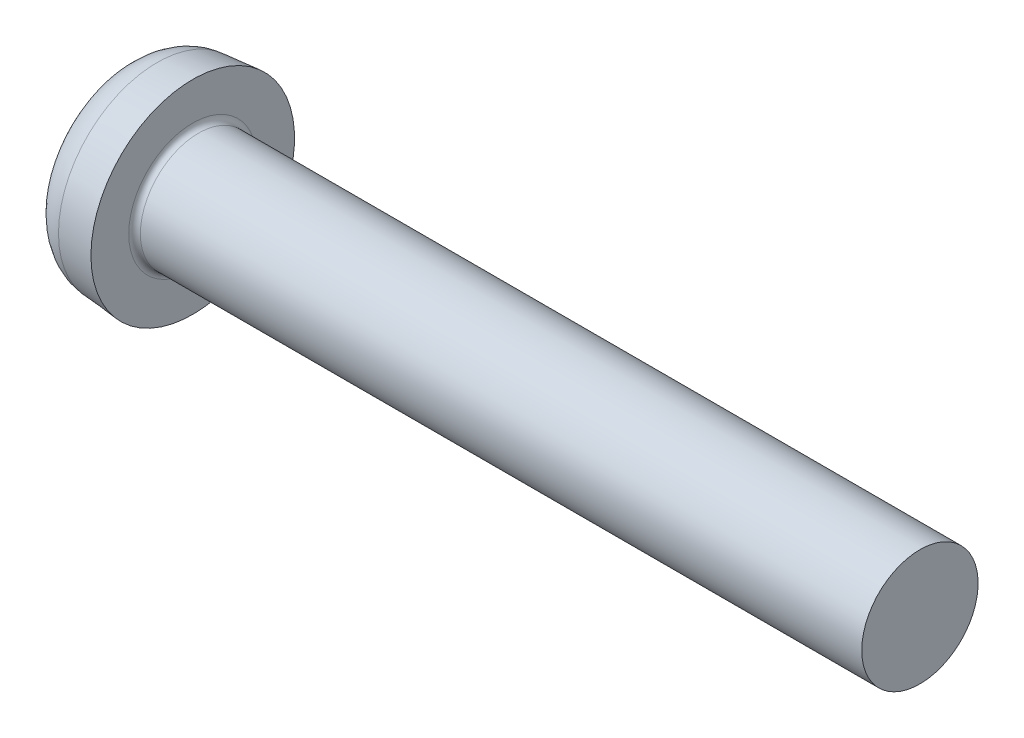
ISO-10303-21;
HEADER;
FILE_DESCRIPTION(('STEP AP214'),'2;1');
FILE_NAME('part.step','',(''),(''),'','','');
FILE_SCHEMA(('AUTOMOTIVE_DESIGN { 1 0 10303 214 1 1 1 1 }'));
ENDSEC;
DATA;
#1=APPLICATION_CONTEXT('core data for automotive mechanical design processes');
#2=APPLICATION_PROTOCOL_DEFINITION('international standard','automotive_design',2000,#1);
#3=PRODUCT_CONTEXT('',#1,'mechanical');
#4=PRODUCT('Part','Part','',(#3));
#5=PRODUCT_RELATED_PRODUCT_CATEGORY('part','',(#4));
#6=PRODUCT_DEFINITION_FORMATION('','',#4);
#7=PRODUCT_DEFINITION_CONTEXT('part definition',#1,'design');
#8=PRODUCT_DEFINITION('design','',#6,#7);
#9=PRODUCT_DEFINITION_SHAPE('','',#8);
#10=(LENGTH_UNIT() NAMED_UNIT(*) SI_UNIT(.MILLI.,.METRE.));
#11=(NAMED_UNIT(*) PLANE_ANGLE_UNIT() SI_UNIT($,.RADIAN.));
#12=(NAMED_UNIT(*) SI_UNIT($,.STERADIAN.) SOLID_ANGLE_UNIT());
#13=UNCERTAINTY_MEASURE_WITH_UNIT(LENGTH_MEASURE(1.E-05),#10,'distance_accuracy_value','');
#14=(GEOMETRIC_REPRESENTATION_CONTEXT(3) GLOBAL_UNCERTAINTY_ASSIGNED_CONTEXT((#13)) GLOBAL_UNIT_ASSIGNED_CONTEXT((#10,
#11,#12)) REPRESENTATION_CONTEXT('',''));
#15=CARTESIAN_POINT('',(0.,0.,0.));
#16=DIRECTION('',(0.,0.,1.));
#17=DIRECTION('',(1.,0.,0.));
#18=AXIS2_PLACEMENT_3D('',#15,#16,#17);
#19=CARTESIAN_POINT('',(18.,0.,0.));
#20=DIRECTION('',(-1.,0.,0.));
#21=DIRECTION('',(0.,1.,0.));
#22=AXIS2_PLACEMENT_3D('',#19,#20,#21);
#23=SPHERICAL_SURFACE('',#22,18.);
#24=CARTESIAN_POINT('',(0.681056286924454,0.,0.));
#25=DIRECTION('',(-1.,0.,0.));
#26=DIRECTION('',(0.,0.,1.));
#27=AXIS2_PLACEMENT_3D('',#24,#25,#26);
#28=CIRCLE('',#27,4.90450697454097);
#29=CARTESIAN_POINT('',(0.681056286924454,0.,4.90450697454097));
#30=VERTEX_POINT('',#29);
#31=EDGE_CURVE('E824',#30,#30,#28,.T.);
#32=ORIENTED_EDGE('',*,*,#31,.T.);
#33=EDGE_LOOP('',(#32));
#34=FACE_BOUND('',#33,.T.);
#35=CARTESIAN_POINT('',(0.0985216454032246,0.,0.));
#36=DIRECTION('',(1.,0.,0.));
#37=DIRECTION('',(0.,0.,-1.));
#38=AXIS2_PLACEMENT_3D('',#35,#36,#37);
#39=CIRCLE('',#38,1.88071069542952);
#40=CARTESIAN_POINT('',(0.0985216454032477,-0.857999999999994,-1.67359156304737));
#41=VERTEX_POINT('',#40);
#42=CARTESIAN_POINT('',(0.0985216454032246,-1.67359156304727,-0.857999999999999));
#43=VERTEX_POINT('',#42);
#44=EDGE_CURVE('E616',#41,#43,#39,.F.);
#45=ORIENTED_EDGE('',*,*,#44,.F.);
#46=CARTESIAN_POINT('',(18.,-0.858000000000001,0.));
#47=DIRECTION('',(0.,1.,0.));
#48=DIRECTION('',(0.,0.,1.));
#49=AXIS2_PLACEMENT_3D('',#46,#47,#48);
#50=CIRCLE('',#49,17.9795393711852);
#51=CARTESIAN_POINT('',(0.40489566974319,-0.857999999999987,-3.69812649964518));
#52=VERTEX_POINT('',#51);
#53=EDGE_CURVE('E525',#52,#41,#50,.T.);
#54=ORIENTED_EDGE('',*,*,#53,.F.);
#55=CARTESIAN_POINT('',(15.9736752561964,0.,4.06417936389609));
#56=DIRECTION('',(-0.446197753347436,0.,0.894934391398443));
#57=DIRECTION('',(0.894934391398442,0.,0.446197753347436));
#58=AXIS2_PLACEMENT_3D('',#55,#56,#57);
#59=CIRCLE('',#58,17.4177051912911);
#60=CARTESIAN_POINT('',(0.404895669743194,0.858000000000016,-3.69812649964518));
#61=VERTEX_POINT('',#60);
#62=EDGE_CURVE('E60',#61,#52,#59,.T.);
#63=ORIENTED_EDGE('',*,*,#62,.F.);
#64=CARTESIAN_POINT('',(18.,0.857999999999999,0.));
#65=DIRECTION('',(0.,-1.,0.));
#66=DIRECTION('',(0.,0.,-1.));
#67=AXIS2_PLACEMENT_3D('',#64,#65,#66);
#68=CIRCLE('',#67,17.9795393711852);
#69=CARTESIAN_POINT('',(0.0985216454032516,0.858000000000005,-1.67359156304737));
#70=VERTEX_POINT('',#69);
#71=EDGE_CURVE('E517',#70,#61,#68,.T.);
#72=ORIENTED_EDGE('',*,*,#71,.F.);
#73=CARTESIAN_POINT('',(0.0985216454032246,1.67359156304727,-0.857999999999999));
#74=VERTEX_POINT('',#73);
#75=EDGE_CURVE('E358',#74,#70,#39,.F.);
#76=ORIENTED_EDGE('',*,*,#75,.F.);
#77=CARTESIAN_POINT('',(18.,0.,-0.857999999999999));
#78=DIRECTION('',(0.,0.,1.));
#79=DIRECTION('',(1.,0.,0.));
#80=AXIS2_PLACEMENT_3D('',#77,#78,#79);
#81=CIRCLE('',#80,17.9795393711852);
#82=CARTESIAN_POINT('',(0.404895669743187,3.69812649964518,-0.858));
#83=VERTEX_POINT('',#82);
#84=EDGE_CURVE('E631',#83,#74,#81,.T.);
#85=ORIENTED_EDGE('',*,*,#84,.F.);
#86=CARTESIAN_POINT('',(15.9736752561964,-4.06417936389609,0.));
#87=DIRECTION('',(-0.446197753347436,-0.894934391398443,0.));
#88=DIRECTION('',(0.894934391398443,-0.446197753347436,0.));
#89=AXIS2_PLACEMENT_3D('',#86,#87,#88);
#90=CIRCLE('',#89,17.4177051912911);
#91=CARTESIAN_POINT('',(0.404895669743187,3.69812649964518,0.858));
#92=VERTEX_POINT('',#91);
#93=EDGE_CURVE('E632',#92,#83,#90,.T.);
#94=ORIENTED_EDGE('',*,*,#93,.F.);
#95=CARTESIAN_POINT('',(18.,0.,0.858000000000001));
#96=DIRECTION('',(0.,0.,-1.));
#97=DIRECTION('',(0.,1.,0.));
#98=AXIS2_PLACEMENT_3D('',#95,#96,#97);
#99=CIRCLE('',#98,17.9795393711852);
#100=CARTESIAN_POINT('',(0.0985216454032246,1.67359156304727,0.858));
#101=VERTEX_POINT('',#100);
#102=EDGE_CURVE('E76',#101,#92,#99,.T.);
#103=ORIENTED_EDGE('',*,*,#102,.F.);
#104=CARTESIAN_POINT('',(0.0985216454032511,0.857999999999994,1.67359156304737));
#105=VERTEX_POINT('',#104);
#106=EDGE_CURVE('E593',#105,#101,#39,.F.);
#107=ORIENTED_EDGE('',*,*,#106,.F.);
#108=CARTESIAN_POINT('',(0.404895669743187,0.857999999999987,3.69812649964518));
#109=VERTEX_POINT('',#108);
#110=EDGE_CURVE('E529',#109,#105,#68,.T.);
#111=ORIENTED_EDGE('',*,*,#110,.F.);
#112=CARTESIAN_POINT('',(15.9736752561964,0.,-4.06417936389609));
#113=DIRECTION('',(-0.446197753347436,0.,-0.894934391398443));
#114=DIRECTION('',(-0.894934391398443,0.,0.446197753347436));
#115=AXIS2_PLACEMENT_3D('',#112,#113,#114);
#116=CIRCLE('',#115,17.4177051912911);
#117=CARTESIAN_POINT('',(0.404895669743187,-0.858000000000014,3.69812649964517));
#118=VERTEX_POINT('',#117);
#119=EDGE_CURVE('E643',#118,#109,#116,.T.);
#120=ORIENTED_EDGE('',*,*,#119,.F.);
#121=CARTESIAN_POINT('',(0.0985216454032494,-0.858000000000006,1.67359156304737));
#122=VERTEX_POINT('',#121);
#123=EDGE_CURVE('E528',#122,#118,#50,.T.);
#124=ORIENTED_EDGE('',*,*,#123,.F.);
#125=CARTESIAN_POINT('',(0.0985216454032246,-1.67359156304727,0.858));
#126=VERTEX_POINT('',#125);
#127=EDGE_CURVE('E613',#126,#122,#39,.F.);
#128=ORIENTED_EDGE('',*,*,#127,.F.);
#129=CARTESIAN_POINT('',(0.40489566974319,-3.69812649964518,0.858));
#130=VERTEX_POINT('',#129);
#131=EDGE_CURVE('E639',#130,#126,#99,.T.);
#132=ORIENTED_EDGE('',*,*,#131,.F.);
#133=CARTESIAN_POINT('',(15.9736752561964,4.06417936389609,0.));
#134=DIRECTION('',(-0.446197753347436,0.894934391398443,0.));
#135=DIRECTION('',(-0.894934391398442,-0.446197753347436,0.));
#136=AXIS2_PLACEMENT_3D('',#133,#134,#135);
#137=CIRCLE('',#136,17.4177051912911);
#138=CARTESIAN_POINT('',(0.404895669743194,-3.69812649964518,-0.858000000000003));
#139=VERTEX_POINT('',#138);
#140=EDGE_CURVE('E630',#139,#130,#137,.T.);
#141=ORIENTED_EDGE('',*,*,#140,.F.);
#142=EDGE_CURVE('E628',#43,#139,#81,.T.);
#143=ORIENTED_EDGE('',*,*,#142,.F.);
#144=EDGE_LOOP('',(#45,#54,#63,#72,#76,#85,#94,#103,#107,#111,#120,#124,#128,#132,#141,#143));
#145=FACE_BOUND('',#144,.T.);
#146=ADVANCED_FACE('F50',(#34,#145),#23,.T.);
#147=CARTESIAN_POINT('',(4.36,-1.72618455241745,0.858));
#148=DIRECTION('',(0.,0.,-1.));
#149=DIRECTION('',(0.,1.,0.));
#150=AXIS2_PLACEMENT_3D('',#147,#148,#149);
#151=PLANE('',#150);
#152=ORIENTED_EDGE('',*,*,#131,.T.);
#153=CARTESIAN_POINT('',(0.0407195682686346,-1.67813241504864,0.858));
#154=CARTESIAN_POINT('',(0.626200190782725,-1.63212706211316,0.858));
#155=CARTESIAN_POINT('',(1.21165435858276,-1.58577517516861,0.858));
#156=CARTESIAN_POINT('',(2.38247964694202,-1.49205354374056,0.858));
#157=CARTESIAN_POINT('',(2.96785076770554,-1.4446838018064,0.858));
#158=CARTESIAN_POINT('',(3.82218995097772,-1.37456191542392,0.858));
#159=CARTESIAN_POINT('',(4.09120149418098,-1.35233936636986,0.858));
#160=CARTESIAN_POINT('',(4.3602,-1.32995920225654,0.858));
#161=B_SPLINE_CURVE_WITH_KNOTS('',3,(#153,#154,#155,#156,#157,#158,#159,#160),.UNSPECIFIED.,.F.,
.F.,(4,2,2,4),(0.,1.76185713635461,3.52370986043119,4.33349336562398),.UNSPECIFIED.);
#162=CARTESIAN_POINT('',(4.36,-1.32997584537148,0.858000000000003));
#163=VERTEX_POINT('',#162);
#164=EDGE_CURVE('E617',#126,#163,#161,.T.);
#165=ORIENTED_EDGE('',*,*,#164,.T.);
#166=DIRECTION('',(0.,-1.,0.));
#167=VECTOR('',#166,1.);
#168=CARTESIAN_POINT('',(4.36,1.72618455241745,0.858));
#169=LINE('',#168,#167);
#170=CARTESIAN_POINT('',(4.36,-1.72618455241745,0.858));
#171=VERTEX_POINT('',#170);
#172=EDGE_CURVE('E406',#163,#171,#169,.T.);
#173=ORIENTED_EDGE('',*,*,#172,.T.);
#174=DIRECTION('',(0.894934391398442,0.446197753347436,0.));
#175=VECTOR('',#174,1.);
#176=CARTESIAN_POINT('',(0.,-3.9,0.858));
#177=LINE('',#176,#175);
#178=EDGE_CURVE('E541',#130,#171,#177,.T.);
#179=ORIENTED_EDGE('',*,*,#178,.F.);
#180=EDGE_LOOP('',(#152,#165,#173,#179));
#181=FACE_BOUND('',#180,.T.);
#182=ADVANCED_FACE('F180',(#181),#151,.T.);
#183=CARTESIAN_POINT('',(4.36,1.72618455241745,0.858));
#184=VERTEX_POINT('',#183);
#185=CARTESIAN_POINT('',(4.36,1.32997584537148,0.858000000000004));
#186=VERTEX_POINT('',#185);
#187=EDGE_CURVE('E560',#184,#186,#169,.T.);
#188=ORIENTED_EDGE('',*,*,#187,.T.);
#189=CARTESIAN_POINT('',(4.3602,1.32995920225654,0.858));
#190=CARTESIAN_POINT('',(3.86872909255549,1.37084380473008,0.858));
#191=CARTESIAN_POINT('',(3.3772150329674,1.41120541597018,0.858));
#192=CARTESIAN_POINT('',(2.39411826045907,1.49107412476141,0.858));
#193=CARTESIAN_POINT('',(1.90253554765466,1.53058122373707,0.858));
#194=CARTESIAN_POINT('',(1.1825694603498,1.58795432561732,0.858));
#195=CARTESIAN_POINT('',(0.954206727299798,1.60608026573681,0.858));
#196=CARTESIAN_POINT('',(0.497470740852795,1.64220136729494,0.858));
#197=CARTESIAN_POINT('',(0.269097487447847,1.66019652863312,0.858));
#198=CARTESIAN_POINT('',(0.0407195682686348,1.67813241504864,0.858));
#199=B_SPLINE_CURVE_WITH_KNOTS('',3,(#189,#190,#191,#192,#193,#194,#195,#196,#197,#198),
.UNSPECIFIED.,.F.,.F.,(4,2,2,2,4),(0.,1.47950483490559,2.9590072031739,3.64625007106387,
4.33349346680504),.UNSPECIFIED.);
#200=EDGE_CURVE('E612',#186,#101,#199,.T.);
#201=ORIENTED_EDGE('',*,*,#200,.T.);
#202=ORIENTED_EDGE('',*,*,#102,.T.);
#203=DIRECTION('',(0.894934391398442,-0.446197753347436,0.));
#204=VECTOR('',#203,1.);
#205=CARTESIAN_POINT('',(0.,3.9,0.858));
#206=LINE('',#205,#204);
#207=EDGE_CURVE('E538',#92,#184,#206,.T.);
#208=ORIENTED_EDGE('',*,*,#207,.T.);
#209=EDGE_LOOP('',(#188,#201,#202,#208));
#210=FACE_BOUND('',#209,.T.);
#211=ADVANCED_FACE('F185',(#210),#151,.T.);
#212=CARTESIAN_POINT('',(4.36,1.72618455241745,-0.858));
#213=DIRECTION('',(0.,0.,1.));
#214=DIRECTION('',(1.,0.,0.));
#215=AXIS2_PLACEMENT_3D('',#212,#213,#214);
#216=PLANE('',#215);
#217=DIRECTION('',(0.,1.,0.));
#218=VECTOR('',#217,1.);
#219=CARTESIAN_POINT('',(4.36,1.72618455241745,-0.858));
#220=LINE('',#219,#218);
#221=CARTESIAN_POINT('',(4.36,-1.72618455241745,-0.858));
#222=VERTEX_POINT('',#221);
#223=CARTESIAN_POINT('',(4.36,-1.32997584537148,-0.858000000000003));
#224=VERTEX_POINT('',#223);
#225=EDGE_CURVE('E558',#222,#224,#220,.T.);
#226=ORIENTED_EDGE('',*,*,#225,.T.);
#227=CARTESIAN_POINT('',(4.3602,-1.32995920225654,-0.858));
#228=CARTESIAN_POINT('',(3.86872909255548,-1.37084380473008,-0.858));
#229=CARTESIAN_POINT('',(3.37721503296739,-1.41120541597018,-0.858));
#230=CARTESIAN_POINT('',(2.39411826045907,-1.49107412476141,-0.858));
#231=CARTESIAN_POINT('',(1.90253554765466,-1.53058122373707,-0.858));
#232=CARTESIAN_POINT('',(1.1825694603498,-1.58795432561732,-0.858));
#233=CARTESIAN_POINT('',(0.954206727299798,-1.60608026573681,-0.858));
#234=CARTESIAN_POINT('',(0.497470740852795,-1.64220136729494,-0.858));
#235=CARTESIAN_POINT('',(0.269097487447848,-1.66019652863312,-0.858));
#236=CARTESIAN_POINT('',(0.0407195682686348,-1.67813241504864,-0.858));
#237=B_SPLINE_CURVE_WITH_KNOTS('',3,(#227,#228,#229,#230,#231,#232,#233,#234,#235,#236),
.UNSPECIFIED.,.F.,.F.,(4,2,2,2,4),(0.,1.47950483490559,2.9590072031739,3.64625007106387,
4.33349346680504),.UNSPECIFIED.);
#238=EDGE_CURVE('E621',#224,#43,#237,.T.);
#239=ORIENTED_EDGE('',*,*,#238,.T.);
#240=ORIENTED_EDGE('',*,*,#142,.T.);
#241=DIRECTION('',(0.894934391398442,0.446197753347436,0.));
#242=VECTOR('',#241,1.);
#243=CARTESIAN_POINT('',(0.,-3.9,-0.858000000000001));
#244=LINE('',#243,#242);
#245=EDGE_CURVE('E537',#139,#222,#244,.T.);
#246=ORIENTED_EDGE('',*,*,#245,.T.);
#247=EDGE_LOOP('',(#226,#239,#240,#246));
#248=FACE_BOUND('',#247,.T.);
#249=ADVANCED_FACE('F366',(#248),#216,.T.);
#250=ORIENTED_EDGE('',*,*,#84,.T.);
#251=CARTESIAN_POINT('',(0.0407195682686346,1.67813241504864,-0.858));
#252=CARTESIAN_POINT('',(0.626200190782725,1.63212706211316,-0.858));
#253=CARTESIAN_POINT('',(1.21165435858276,1.58577517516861,-0.858));
#254=CARTESIAN_POINT('',(2.38247964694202,1.49205354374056,-0.858));
#255=CARTESIAN_POINT('',(2.96785076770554,1.4446838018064,-0.858));
#256=CARTESIAN_POINT('',(3.82218995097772,1.37456191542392,-0.858));
#257=CARTESIAN_POINT('',(4.09120149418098,1.35233936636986,-0.858));
#258=CARTESIAN_POINT('',(4.3602,1.32995920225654,-0.858));
#259=B_SPLINE_CURVE_WITH_KNOTS('',3,(#251,#252,#253,#254,#255,#256,#257,#258),.UNSPECIFIED.,.F.,
.F.,(4,2,2,4),(0.,1.76185713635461,3.52370986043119,4.33349336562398),.UNSPECIFIED.);
#260=CARTESIAN_POINT('',(4.36,1.32997584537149,-0.858000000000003));
#261=VERTEX_POINT('',#260);
#262=EDGE_CURVE('E355',#74,#261,#259,.T.);
#263=ORIENTED_EDGE('',*,*,#262,.T.);
#264=CARTESIAN_POINT('',(4.36,1.72618455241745,-0.858));
#265=VERTEX_POINT('',#264);
#266=EDGE_CURVE('E394',#261,#265,#220,.T.);
#267=ORIENTED_EDGE('',*,*,#266,.T.);
#268=DIRECTION('',(0.894934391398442,-0.446197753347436,0.));
#269=VECTOR('',#268,1.);
#270=CARTESIAN_POINT('',(0.,3.9,-0.858));
#271=LINE('',#270,#269);
#272=EDGE_CURVE('E535',#83,#265,#271,.T.);
#273=ORIENTED_EDGE('',*,*,#272,.F.);
#274=EDGE_LOOP('',(#250,#263,#267,#273));
#275=FACE_BOUND('',#274,.T.);
#276=ADVANCED_FACE('F217',(#275),#216,.T.);
#277=CARTESIAN_POINT('',(4.36,1.72618455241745,0.858));
#278=DIRECTION('',(1.,0.,0.));
#279=DIRECTION('',(0.,0.,-1.));
#280=AXIS2_PLACEMENT_3D('',#277,#278,#279);
#281=PLANE('',#280);
#282=CARTESIAN_POINT('',(4.36,0.,0.));
#283=DIRECTION('',(-1.,0.,0.));
#284=DIRECTION('',(0.,0.,1.));
#285=AXIS2_PLACEMENT_3D('',#282,#283,#284);
#286=CIRCLE('',#285,1.58271909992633);
#287=EDGE_CURVE('E569',#224,#163,#286,.T.);
#288=ORIENTED_EDGE('',*,*,#287,.F.);
#289=ORIENTED_EDGE('',*,*,#225,.F.);
#290=DIRECTION('',(0.,0.,-1.));
#291=VECTOR('',#290,1.);
#292=CARTESIAN_POINT('',(4.36,-1.72618455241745,0.858));
#293=LINE('',#292,#291);
#294=EDGE_CURVE('E425',#171,#222,#293,.T.);
#295=ORIENTED_EDGE('',*,*,#294,.F.);
#296=ORIENTED_EDGE('',*,*,#172,.F.);
#297=EDGE_LOOP('',(#288,#289,#295,#296));
#298=FACE_BOUND('',#297,.T.);
#299=ADVANCED_FACE('F212',(#298),#281,.F.);
#300=CARTESIAN_POINT('',(4.36,-0.858000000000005,1.32997584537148));
#301=VERTEX_POINT('',#300);
#302=CARTESIAN_POINT('',(4.36,0.857999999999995,1.32997584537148));
#303=VERTEX_POINT('',#302);
#304=EDGE_CURVE('E585',#301,#303,#286,.T.);
#305=ORIENTED_EDGE('',*,*,#304,.F.);
#306=DIRECTION('',(0.,0.,-1.));
#307=VECTOR('',#306,1.);
#308=CARTESIAN_POINT('',(4.36,-0.858000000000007,1.72618455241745));
#309=LINE('',#308,#307);
#310=CARTESIAN_POINT('',(4.36,-0.858000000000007,1.72618455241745));
#311=VERTEX_POINT('',#310);
#312=EDGE_CURVE('E54',#311,#301,#309,.T.);
#313=ORIENTED_EDGE('',*,*,#312,.F.);
#314=DIRECTION('',(0.,-1.,0.));
#315=VECTOR('',#314,1.);
#316=CARTESIAN_POINT('',(4.36,-0.858000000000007,1.72618455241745));
#317=LINE('',#316,#315);
#318=CARTESIAN_POINT('',(4.36,0.857999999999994,1.72618455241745));
#319=VERTEX_POINT('',#318);
#320=EDGE_CURVE('E498',#319,#311,#317,.T.);
#321=ORIENTED_EDGE('',*,*,#320,.F.);
#322=DIRECTION('',(0.,0.,1.));
#323=VECTOR('',#322,1.);
#324=CARTESIAN_POINT('',(4.36,0.857999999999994,1.72618455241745));
#325=LINE('',#324,#323);
#326=EDGE_CURVE('E291',#303,#319,#325,.T.);
#327=ORIENTED_EDGE('',*,*,#326,.F.);
#328=EDGE_LOOP('',(#305,#313,#321,#327));
#329=FACE_BOUND('',#328,.T.);
#330=ADVANCED_FACE('F216',(#329),#281,.F.);
#331=EDGE_CURVE('E563',#186,#261,#286,.T.);
#332=ORIENTED_EDGE('',*,*,#331,.F.);
#333=ORIENTED_EDGE('',*,*,#187,.F.);
#334=DIRECTION('',(0.,0.,1.));
#335=VECTOR('',#334,1.);
#336=CARTESIAN_POINT('',(4.36,1.72618455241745,0.858));
#337=LINE('',#336,#335);
#338=EDGE_CURVE('E548',#265,#184,#337,.T.);
#339=ORIENTED_EDGE('',*,*,#338,.F.);
#340=ORIENTED_EDGE('',*,*,#266,.F.);
#341=EDGE_LOOP('',(#332,#333,#339,#340));
#342=FACE_BOUND('',#341,.T.);
#343=ADVANCED_FACE('F561',(#342),#281,.F.);
#344=CARTESIAN_POINT('',(4.36,0.858000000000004,-1.32997584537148));
#345=VERTEX_POINT('',#344);
#346=CARTESIAN_POINT('',(4.36,-0.857999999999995,-1.32997584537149));
#347=VERTEX_POINT('',#346);
#348=EDGE_CURVE('E494',#345,#347,#286,.T.);
#349=ORIENTED_EDGE('',*,*,#348,.F.);
#350=CARTESIAN_POINT('',(4.36,0.858000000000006,-1.72618455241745));
#351=VERTEX_POINT('',#350);
#352=EDGE_CURVE('E491',#351,#345,#325,.T.);
#353=ORIENTED_EDGE('',*,*,#352,.F.);
#354=DIRECTION('',(0.,1.,0.));
#355=VECTOR('',#354,1.);
#356=CARTESIAN_POINT('',(4.36,-0.857999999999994,-1.72618455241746));
#357=LINE('',#356,#355);
#358=CARTESIAN_POINT('',(4.36,-0.857999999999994,-1.72618455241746));
#359=VERTEX_POINT('',#358);
#360=EDGE_CURVE('E492',#359,#351,#357,.T.);
#361=ORIENTED_EDGE('',*,*,#360,.F.);
#362=EDGE_CURVE('E357',#347,#359,#309,.T.);
#363=ORIENTED_EDGE('',*,*,#362,.F.);
#364=EDGE_LOOP('',(#349,#353,#361,#363));
#365=FACE_BOUND('',#364,.T.);
#366=ADVANCED_FACE('F219',(#365),#281,.F.);
#367=CARTESIAN_POINT('',(4.36,0.857999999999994,1.72618455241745));
#368=DIRECTION('',(0.,-1.,0.));
#369=DIRECTION('',(1.,0.,0.));
#370=AXIS2_PLACEMENT_3D('',#367,#368,#369);
#371=PLANE('',#370);
#372=ORIENTED_EDGE('',*,*,#352,.T.);
#373=CARTESIAN_POINT('',(4.3602,0.858000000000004,-1.32995920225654));
#374=CARTESIAN_POINT('',(3.86872909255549,0.858000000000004,-1.37084380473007));
#375=CARTESIAN_POINT('',(3.3772150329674,0.858000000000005,-1.41120541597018));
#376=CARTESIAN_POINT('',(2.39411826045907,0.858000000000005,-1.49107412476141));
#377=CARTESIAN_POINT('',(1.90253554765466,0.858000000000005,-1.53058122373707));
#378=CARTESIAN_POINT('',(1.1825694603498,0.858000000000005,-1.58795432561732));
#379=CARTESIAN_POINT('',(0.954206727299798,0.858000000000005,-1.60608026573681));
#380=CARTESIAN_POINT('',(0.497470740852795,0.858000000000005,-1.64220136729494));
#381=CARTESIAN_POINT('',(0.269097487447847,0.858000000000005,-1.66019652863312));
#382=CARTESIAN_POINT('',(0.0407195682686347,0.858000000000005,-1.67813241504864));
#383=B_SPLINE_CURVE_WITH_KNOTS('',3,(#373,#374,#375,#376,#377,#378,#379,#380,#381,#382),
.UNSPECIFIED.,.F.,.F.,(4,2,2,2,4),(0.,1.47950483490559,2.9590072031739,3.64625007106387,
4.33349346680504),.UNSPECIFIED.);
#384=EDGE_CURVE('E354',#345,#70,#383,.T.);
#385=ORIENTED_EDGE('',*,*,#384,.T.);
#386=ORIENTED_EDGE('',*,*,#71,.T.);
#387=DIRECTION('',(0.894934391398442,0.,0.446197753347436));
#388=VECTOR('',#387,1.);
#389=CARTESIAN_POINT('',(0.,0.858000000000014,-3.9));
#390=LINE('',#389,#388);
#391=EDGE_CURVE('E503',#61,#351,#390,.T.);
#392=ORIENTED_EDGE('',*,*,#391,.T.);
#393=EDGE_LOOP('',(#372,#385,#386,#392));
#394=FACE_BOUND('',#393,.T.);
#395=ADVANCED_FACE('F301',(#394),#371,.T.);
#396=CARTESIAN_POINT('',(4.36,-0.857999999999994,-1.72618455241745));
#397=DIRECTION('',(0.,1.,0.));
#398=DIRECTION('',(0.,0.,1.));
#399=AXIS2_PLACEMENT_3D('',#396,#397,#398);
#400=PLANE('',#399);
#401=ORIENTED_EDGE('',*,*,#53,.T.);
#402=CARTESIAN_POINT('',(0.0407195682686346,-0.857999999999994,-1.67813241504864));
#403=CARTESIAN_POINT('',(0.626200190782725,-0.857999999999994,-1.63212706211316));
#404=CARTESIAN_POINT('',(1.21165435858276,-0.857999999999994,-1.58577517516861));
#405=CARTESIAN_POINT('',(2.38247964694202,-0.857999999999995,-1.49205354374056));
#406=CARTESIAN_POINT('',(2.96785076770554,-0.857999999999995,-1.4446838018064));
#407=CARTESIAN_POINT('',(3.82218995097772,-0.857999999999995,-1.37456191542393));
#408=CARTESIAN_POINT('',(4.09120149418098,-0.857999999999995,-1.35233936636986));
#409=CARTESIAN_POINT('',(4.3602,-0.857999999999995,-1.32995920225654));
#410=B_SPLINE_CURVE_WITH_KNOTS('',3,(#402,#403,#404,#405,#406,#407,#408,#409),.UNSPECIFIED.,.F.,
.F.,(4,2,2,4),(0.,1.76185713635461,3.52370986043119,4.33349336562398),.UNSPECIFIED.);
#411=EDGE_CURVE('E620',#41,#347,#410,.T.);
#412=ORIENTED_EDGE('',*,*,#411,.T.);
#413=ORIENTED_EDGE('',*,*,#362,.T.);
#414=DIRECTION('',(0.894934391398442,0.,0.446197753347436));
#415=VECTOR('',#414,1.);
#416=CARTESIAN_POINT('',(0.,-0.857999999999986,-3.9));
#417=LINE('',#416,#415);
#418=EDGE_CURVE('E506',#52,#359,#417,.T.);
#419=ORIENTED_EDGE('',*,*,#418,.F.);
#420=EDGE_LOOP('',(#401,#412,#413,#419));
#421=FACE_BOUND('',#420,.T.);
#422=ADVANCED_FACE('F462',(#421),#400,.T.);
#423=ORIENTED_EDGE('',*,*,#312,.T.);
#424=CARTESIAN_POINT('',(4.3602,-0.858000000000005,1.32995920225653));
#425=CARTESIAN_POINT('',(3.86872909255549,-0.858000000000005,1.37084380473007));
#426=CARTESIAN_POINT('',(3.3772150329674,-0.858000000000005,1.41120541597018));
#427=CARTESIAN_POINT('',(2.39411826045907,-0.858000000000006,1.49107412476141));
#428=CARTESIAN_POINT('',(1.90253554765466,-0.858000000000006,1.53058122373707));
#429=CARTESIAN_POINT('',(1.1825694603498,-0.858000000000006,1.58795432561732));
#430=CARTESIAN_POINT('',(0.954206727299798,-0.858000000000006,1.60608026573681));
#431=CARTESIAN_POINT('',(0.497470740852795,-0.858000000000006,1.64220136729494));
#432=CARTESIAN_POINT('',(0.269097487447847,-0.858000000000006,1.66019652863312));
#433=CARTESIAN_POINT('',(0.0407195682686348,-0.858000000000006,1.67813241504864));
#434=B_SPLINE_CURVE_WITH_KNOTS('',3,(#424,#425,#426,#427,#428,#429,#430,#431,#432,#433),
.UNSPECIFIED.,.F.,.F.,(4,2,2,2,4),(0.,1.47950483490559,2.9590072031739,3.64625007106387,
4.33349346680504),.UNSPECIFIED.);
#435=EDGE_CURVE('E615',#301,#122,#434,.T.);
#436=ORIENTED_EDGE('',*,*,#435,.T.);
#437=ORIENTED_EDGE('',*,*,#123,.T.);
#438=DIRECTION('',(0.894934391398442,0.,-0.446197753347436));
#439=VECTOR('',#438,1.);
#440=CARTESIAN_POINT('',(0.,-0.858000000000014,3.9));
#441=LINE('',#440,#439);
#442=EDGE_CURVE('E515',#118,#311,#441,.T.);
#443=ORIENTED_EDGE('',*,*,#442,.T.);
#444=EDGE_LOOP('',(#423,#436,#437,#443));
#445=FACE_BOUND('',#444,.T.);
#446=ADVANCED_FACE('F470',(#445),#400,.T.);
#447=ORIENTED_EDGE('',*,*,#110,.T.);
#448=CARTESIAN_POINT('',(0.0407195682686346,0.857999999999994,1.67813241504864));
#449=CARTESIAN_POINT('',(0.626200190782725,0.857999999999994,1.63212706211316));
#450=CARTESIAN_POINT('',(1.21165435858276,0.857999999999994,1.58577517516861));
#451=CARTESIAN_POINT('',(2.38247964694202,0.857999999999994,1.49205354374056));
#452=CARTESIAN_POINT('',(2.96785076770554,0.857999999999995,1.4446838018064));
#453=CARTESIAN_POINT('',(3.82218995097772,0.857999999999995,1.37456191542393));
#454=CARTESIAN_POINT('',(4.09120149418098,0.857999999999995,1.35233936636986));
#455=CARTESIAN_POINT('',(4.3602,0.857999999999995,1.32995920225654));
#456=B_SPLINE_CURVE_WITH_KNOTS('',3,(#448,#449,#450,#451,#452,#453,#454,#455),.UNSPECIFIED.,.F.,
.F.,(4,2,2,4),(0.,1.76185713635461,3.52370986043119,4.33349336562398),.UNSPECIFIED.);
#457=EDGE_CURVE('E12',#105,#303,#456,.T.);
#458=ORIENTED_EDGE('',*,*,#457,.T.);
#459=ORIENTED_EDGE('',*,*,#326,.T.);
#460=DIRECTION('',(0.894934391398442,0.,-0.446197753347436));
#461=VECTOR('',#460,1.);
#462=CARTESIAN_POINT('',(0.,0.857999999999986,3.9));
#463=LINE('',#462,#461);
#464=EDGE_CURVE('E512',#109,#319,#463,.T.);
#465=ORIENTED_EDGE('',*,*,#464,.F.);
#466=EDGE_LOOP('',(#447,#458,#459,#465));
#467=FACE_BOUND('',#466,.T.);
#468=ADVANCED_FACE('F195',(#467),#371,.T.);
#469=CARTESIAN_POINT('',(55.4,4.,0.));
#470=DIRECTION('',(-1.,0.,0.));
#471=DIRECTION('',(0.,0.,1.));
#472=AXIS2_PLACEMENT_3D('',#469,#470,#471);
#473=PLANE('',#472);
#474=CARTESIAN_POINT('',(55.4,0.,0.));
#475=DIRECTION('',(-1.,0.,0.));
#476=DIRECTION('',(0.,0.,1.));
#477=AXIS2_PLACEMENT_3D('',#474,#475,#476);
#478=CIRCLE('',#477,4.);
#479=CARTESIAN_POINT('',(55.4,0.,4.));
#480=VERTEX_POINT('',#479);
#481=EDGE_CURVE('E814',#480,#480,#478,.T.);
#482=ORIENTED_EDGE('',*,*,#481,.F.);
#483=EDGE_LOOP('',(#482));
#484=FACE_BOUND('',#483,.T.);
#485=ADVANCED_FACE('F191',(#484),#473,.F.);
#486=CARTESIAN_POINT('',(0.,0.,0.));
#487=DIRECTION('',(-1.,0.,0.));
#488=DIRECTION('',(0.,0.,1.));
#489=AXIS2_PLACEMENT_3D('',#486,#487,#488);
#490=CYLINDRICAL_SURFACE('',#489,4.);
#491=CARTESIAN_POINT('',(5.8,0.,0.));
#492=DIRECTION('',(-1.,0.,0.));
#493=DIRECTION('',(0.,0.,1.));
#494=AXIS2_PLACEMENT_3D('',#491,#492,#493);
#495=CIRCLE('',#494,4.);
#496=CARTESIAN_POINT('',(5.8,0.,4.));
#497=VERTEX_POINT('',#496);
#498=EDGE_CURVE('E635',#497,#497,#495,.F.);
#499=ORIENTED_EDGE('',*,*,#498,.T.);
#500=EDGE_LOOP('',(#499));
#501=FACE_BOUND('',#500,.T.);
#502=ORIENTED_EDGE('',*,*,#481,.T.);
#503=EDGE_LOOP('',(#502));
#504=FACE_BOUND('',#503,.T.);
#505=ADVANCED_FACE('F194',(#501,#504),#490,.T.);
#506=CARTESIAN_POINT('',(5.4,4.,0.));
#507=DIRECTION('',(-1.,0.,0.));
#508=DIRECTION('',(0.,0.,1.));
#509=AXIS2_PLACEMENT_3D('',#506,#507,#508);
#510=PLANE('',#509);
#511=CARTESIAN_POINT('',(5.4,0.,0.));
#512=DIRECTION('',(-1.,0.,0.));
#513=DIRECTION('',(0.,0.,1.));
#514=AXIS2_PLACEMENT_3D('',#511,#512,#513);
#515=CIRCLE('',#514,4.4);
#516=CARTESIAN_POINT('',(5.4,0.,4.4));
#517=VERTEX_POINT('',#516);
#518=EDGE_CURVE('E813',#517,#517,#515,.T.);
#519=ORIENTED_EDGE('',*,*,#518,.T.);
#520=EDGE_LOOP('',(#519));
#521=FACE_BOUND('',#520,.T.);
#522=CARTESIAN_POINT('',(5.4,0.,0.));
#523=DIRECTION('',(-1.,0.,0.));
#524=DIRECTION('',(0.,0.,1.));
#525=AXIS2_PLACEMENT_3D('',#522,#523,#524);
#526=CIRCLE('',#525,7.);
#527=CARTESIAN_POINT('',(5.4,0.,7.));
#528=VERTEX_POINT('',#527);
#529=EDGE_CURVE('E817',#528,#528,#526,.T.);
#530=ORIENTED_EDGE('',*,*,#529,.F.);
#531=EDGE_LOOP('',(#530));
#532=FACE_BOUND('',#531,.T.);
#533=ADVANCED_FACE('F199',(#521,#532),#510,.F.);
#534=CARTESIAN_POINT('',(5.4,0.,0.));
#535=DIRECTION('',(1.,0.,0.));
#536=DIRECTION('',(0.,0.,-1.));
#537=AXIS2_PLACEMENT_3D('',#534,#535,#536);
#538=CONICAL_SURFACE('',#537,7.,0.0872664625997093);
#539=CARTESIAN_POINT('',(2.95607655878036,0.,0.));
#540=DIRECTION('',(-1.,0.,0.));
#541=DIRECTION('',(0.,0.,1.));
#542=AXIS2_PLACEMENT_3D('',#539,#540,#541);
#543=CIRCLE('',#542,6.78618440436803);
#544=CARTESIAN_POINT('',(2.95607655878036,0.,6.78618440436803));
#545=VERTEX_POINT('',#544);
#546=EDGE_CURVE('E822',#545,#545,#543,.T.);
#547=ORIENTED_EDGE('',*,*,#546,.F.);
#548=EDGE_LOOP('',(#547));
#549=FACE_BOUND('',#548,.T.);
#550=ORIENTED_EDGE('',*,*,#529,.T.);
#551=EDGE_LOOP('',(#550));
#552=FACE_BOUND('',#551,.T.);
#553=ADVANCED_FACE('F203',(#549,#552),#538,.T.);
#554=CARTESIAN_POINT('',(3.18268148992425,0.,0.));
#555=DIRECTION('',(-1.,0.,0.));
#556=DIRECTION('',(0.,0.,1.));
#557=AXIS2_PLACEMENT_3D('',#554,#555,#556);
#558=TOROIDAL_SURFACE('',#557,4.19607818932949,2.6);
#559=ORIENTED_EDGE('',*,*,#31,.F.);
#560=EDGE_LOOP('',(#559));
#561=FACE_BOUND('',#560,.T.);
#562=ORIENTED_EDGE('',*,*,#546,.T.);
#563=EDGE_LOOP('',(#562));
#564=FACE_BOUND('',#563,.T.);
#565=ADVANCED_FACE('F207',(#561,#564),#558,.T.);
#566=CARTESIAN_POINT('',(5.8,0.,0.));
#567=DIRECTION('',(-1.,0.,0.));
#568=DIRECTION('',(0.,0.,1.));
#569=AXIS2_PLACEMENT_3D('',#566,#567,#568);
#570=TOROIDAL_SURFACE('',#569,4.4,0.4);
#571=ORIENTED_EDGE('',*,*,#498,.F.);
#572=EDGE_LOOP('',(#571));
#573=FACE_BOUND('',#572,.T.);
#574=ORIENTED_EDGE('',*,*,#518,.F.);
#575=EDGE_LOOP('',(#574));
#576=FACE_BOUND('',#575,.T.);
#577=ADVANCED_FACE('F52',(#573,#576),#570,.F.);
#578=CARTESIAN_POINT('',(4.36,-1.72618455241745,-0.858));
#579=DIRECTION('',(-0.446197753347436,0.894934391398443,0.));
#580=DIRECTION('',(-0.894934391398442,-0.446197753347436,0.));
#581=AXIS2_PLACEMENT_3D('',#578,#579,#580);
#582=PLANE('',#581);
#583=ORIENTED_EDGE('',*,*,#140,.T.);
#584=ORIENTED_EDGE('',*,*,#178,.T.);
#585=ORIENTED_EDGE('',*,*,#294,.T.);
#586=ORIENTED_EDGE('',*,*,#245,.F.);
#587=EDGE_LOOP('',(#583,#584,#585,#586));
#588=FACE_BOUND('',#587,.T.);
#589=ADVANCED_FACE('F428',(#588),#582,.T.);
#590=CARTESIAN_POINT('',(4.36,1.72618455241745,0.858));
#591=DIRECTION('',(-0.446197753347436,-0.894934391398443,0.));
#592=DIRECTION('',(0.894934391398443,-0.446197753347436,0.));
#593=AXIS2_PLACEMENT_3D('',#590,#591,#592);
#594=PLANE('',#593);
#595=ORIENTED_EDGE('',*,*,#93,.T.);
#596=ORIENTED_EDGE('',*,*,#272,.T.);
#597=ORIENTED_EDGE('',*,*,#338,.T.);
#598=ORIENTED_EDGE('',*,*,#207,.F.);
#599=EDGE_LOOP('',(#595,#596,#597,#598));
#600=FACE_BOUND('',#599,.T.);
#601=ADVANCED_FACE('F220',(#600),#594,.T.);
#602=CARTESIAN_POINT('',(4.36,0.858000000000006,-1.72618455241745));
#603=DIRECTION('',(-0.446197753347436,0.,0.894934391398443));
#604=DIRECTION('',(-0.894934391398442,0.,-0.446197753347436));
#605=AXIS2_PLACEMENT_3D('',#602,#603,#604);
#606=PLANE('',#605);
#607=ORIENTED_EDGE('',*,*,#62,.T.);
#608=ORIENTED_EDGE('',*,*,#418,.T.);
#609=ORIENTED_EDGE('',*,*,#360,.T.);
#610=ORIENTED_EDGE('',*,*,#391,.F.);
#611=EDGE_LOOP('',(#607,#608,#609,#610));
#612=FACE_BOUND('',#611,.T.);
#613=ADVANCED_FACE('F307',(#612),#606,.T.);
#614=CARTESIAN_POINT('',(4.36,-0.858000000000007,1.72618455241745));
#615=DIRECTION('',(-0.446197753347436,0.,-0.894934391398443));
#616=DIRECTION('',(0.894934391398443,0.,-0.446197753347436));
#617=AXIS2_PLACEMENT_3D('',#614,#615,#616);
#618=PLANE('',#617);
#619=ORIENTED_EDGE('',*,*,#119,.T.);
#620=ORIENTED_EDGE('',*,*,#464,.T.);
#621=ORIENTED_EDGE('',*,*,#320,.T.);
#622=ORIENTED_EDGE('',*,*,#442,.F.);
#623=EDGE_LOOP('',(#619,#620,#621,#622));
#624=FACE_BOUND('',#623,.T.);
#625=ADVANCED_FACE('F436',(#624),#618,.T.);
#626=CARTESIAN_POINT('',(4.36,0.,0.));
#627=DIRECTION('',(-1.,0.,0.));
#628=DIRECTION('',(0.,0.,1.));
#629=AXIS2_PLACEMENT_3D('',#626,#627,#628);
#630=CONICAL_SURFACE('',#629,1.58271909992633,0.0698131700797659);
#631=ORIENTED_EDGE('',*,*,#75,.T.);
#632=ORIENTED_EDGE('',*,*,#384,.F.);
#633=EDGE_CURVE('E603',#261,#345,#286,.T.);
#634=ORIENTED_EDGE('',*,*,#633,.F.);
#635=ORIENTED_EDGE('',*,*,#262,.F.);
#636=EDGE_LOOP('',(#631,#632,#634,#635));
#637=FACE_BOUND('',#636,.T.);
#638=ADVANCED_FACE('F178',(#637),#630,.F.);
#639=EDGE_CURVE('E608',#347,#224,#286,.T.);
#640=ORIENTED_EDGE('',*,*,#639,.F.);
#641=ORIENTED_EDGE('',*,*,#411,.F.);
#642=ORIENTED_EDGE('',*,*,#44,.T.);
#643=ORIENTED_EDGE('',*,*,#238,.F.);
#644=EDGE_LOOP('',(#640,#641,#642,#643));
#645=FACE_BOUND('',#644,.T.);
#646=ADVANCED_FACE('F625',(#645),#630,.F.);
#647=ORIENTED_EDGE('',*,*,#127,.T.);
#648=ORIENTED_EDGE('',*,*,#435,.F.);
#649=EDGE_CURVE('E587',#163,#301,#286,.T.);
#650=ORIENTED_EDGE('',*,*,#649,.F.);
#651=ORIENTED_EDGE('',*,*,#164,.F.);
#652=EDGE_LOOP('',(#647,#648,#650,#651));
#653=FACE_BOUND('',#652,.T.);
#654=ADVANCED_FACE('F176',(#653),#630,.F.);
#655=EDGE_CURVE('E68',#303,#186,#286,.T.);
#656=ORIENTED_EDGE('',*,*,#655,.F.);
#657=ORIENTED_EDGE('',*,*,#457,.F.);
#658=ORIENTED_EDGE('',*,*,#106,.T.);
#659=ORIENTED_EDGE('',*,*,#200,.F.);
#660=EDGE_LOOP('',(#656,#657,#658,#659));
#661=FACE_BOUND('',#660,.T.);
#662=ADVANCED_FACE('F170',(#661),#630,.F.);
#663=CARTESIAN_POINT('',(4.87425660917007,0.,0.));
#664=DIRECTION('',(-1.,0.,0.));
#665=DIRECTION('',(0.,0.,1.));
#666=AXIS2_PLACEMENT_3D('',#663,#664,#665);
#667=CONICAL_SURFACE('',#666,0.,1.25663706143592);
#668=ORIENTED_EDGE('',*,*,#655,.T.);
#669=ORIENTED_EDGE('',*,*,#331,.T.);
#670=ORIENTED_EDGE('',*,*,#633,.T.);
#671=ORIENTED_EDGE('',*,*,#348,.T.);
#672=ORIENTED_EDGE('',*,*,#639,.T.);
#673=ORIENTED_EDGE('',*,*,#287,.T.);
#674=ORIENTED_EDGE('',*,*,#649,.T.);
#675=ORIENTED_EDGE('',*,*,#304,.T.);
#676=EDGE_LOOP('',(#668,#669,#670,#671,#672,#673,#674,#675));
#677=FACE_BOUND('',#676,.T.);
#678=CARTESIAN_POINT('',(4.87425660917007,0.,0.));
#679=VERTEX_POINT('',#678);
#680=VERTEX_LOOP('',#679);
#681=FACE_BOUND('',#680,.T.);
#682=ADVANCED_FACE('F168',(#677,#681),#667,.F.);
#683=CLOSED_SHELL('',(#146,#182,#211,#249,#276,#299,#330,#343,#366,#395,#422,#446,#468,#485,
#505,#533,#553,#565,#577,#589,#601,#613,#625,#638,#646,#654,#662,#682));
#684=MANIFOLD_SOLID_BREP('B2',#683);
#685=ADVANCED_BREP_SHAPE_REPRESENTATION('',(#18,#684),#14);
#686=SHAPE_DEFINITION_REPRESENTATION(#9,#685);
ENDSEC;
END-ISO-10303-21;
